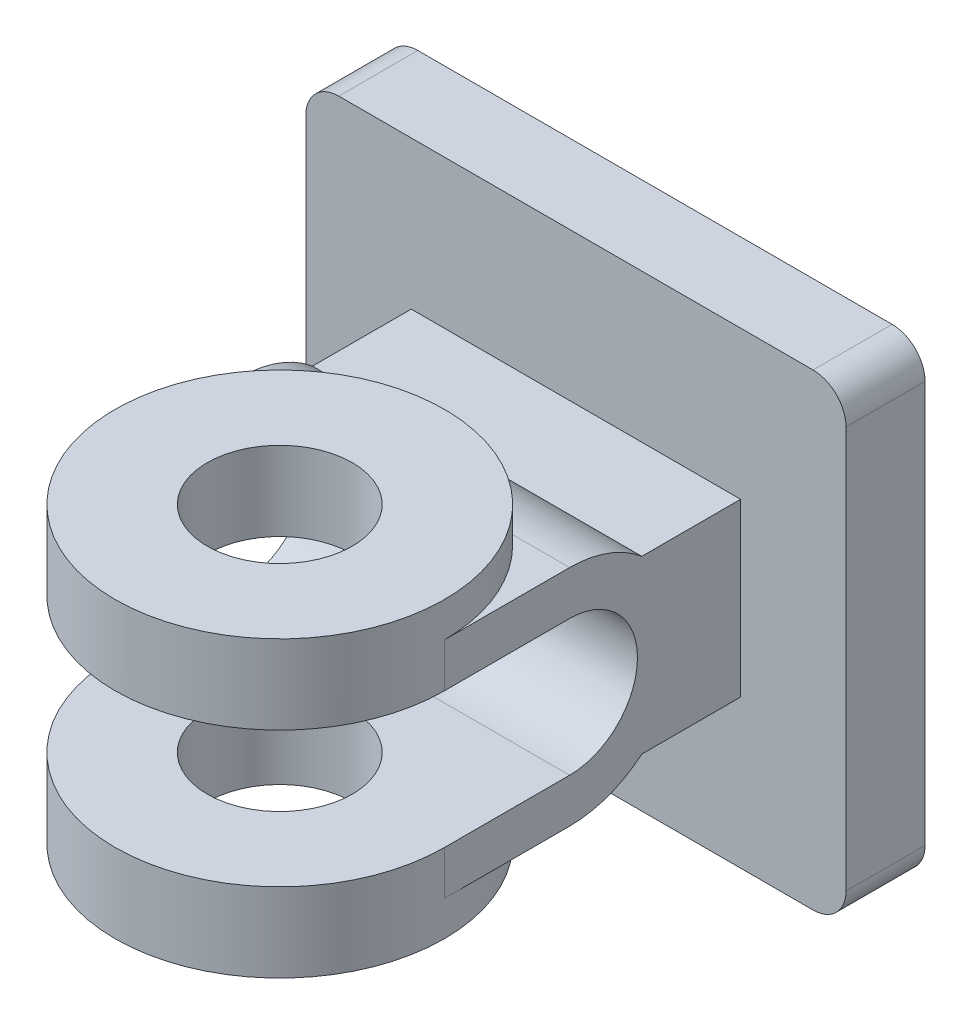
from build123d import *

# Parameters (mm, degrees)
BOSS_EXTRUDE1_DEPTH = 25
SKETCH2_R           = 25
BOSS_EXTRUDE2_DEPTH = 12
SKETCH3_R           = 11
CUT_EXTRUDE1_DEPTH  = 26
SKETCH4_W           = 82
SKETCH4_H           = 71
BOSS_EXTRUDE3_DEPTH = 12
FILLET1_R           = 5
SCALE1_SCALE        = 0.7
SCALE2_SCALE        = 0.5
SCALE3_SCALE        = 1.25


with BuildPart() as part:
    # Sketch1 → Boss-Extrude1 (new, symmetric)
    with BuildSketch(Plane(origin=(0, 0, 0), x_dir=(0, 0, -1), z_dir=(1, 0, 0))):
        with BuildLine():
            Line((10.95445115, 13), (25.95445115, 13))
            Line((25.95445115, 13), (25.95445115, -13))
            Line((25.95445115, -13), (10.95445115, -13))
            ThreePointArc((10.95445115, -13), (5.830951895, -15.968719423), (0, -17))
            Line((0, -17), (-19, -17))
            Line((-19, -17), (-19, -10.3))
            Line((-19, -10.3), (0, -10.3))
            ThreePointArc((0, -10.3), (10.3, 0), (0, 10.3))
            Line((0, 10.3), (-19, 10.3))
            Line((-19, 10.3), (-19, 17))
            Line((-19, 17), (0, 17))
            ThreePointArc((0, 17), (5.830951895, 15.968719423), (10.95445115, 13))
        make_face()
    extrude(amount=BOSS_EXTRUDE1_DEPTH, both=True)

    # Sketch2 → Boss-Extrude2 (add)
    with BuildSketch(Plane(origin=(0, -10.3, 0), x_dir=(1, 0, 0), z_dir=(0, 1, 0))):
        with Locations(Location((0, -19, 0), (0, 0, 270))):
            Circle(SKETCH2_R)
    boss_extrude2 = extrude(amount=-BOSS_EXTRUDE2_DEPTH)

    # Sketch3 → Cut-Extrude1 (cut)
    with BuildSketch(Plane(origin=(0, -10.3, 0), x_dir=(1, 0, 0), z_dir=(0, 1, 0))):
        with Locations(Location((0, -19, 0), (0, 0, 270))):
            Circle(SKETCH3_R)
    cut_extrude1 = extrude(amount=-CUT_EXTRUDE1_DEPTH, mode=Mode.SUBTRACT)

    # Mirror2: Boss-Extrude2, Cut-Extrude1 across plane
    add(boss_extrude2.mirror(Plane.ZX))
    add(cut_extrude1.mirror(Plane.ZX), mode=Mode.SUBTRACT)

    # Sketch4 → Boss-Extrude3 (add)
    with BuildSketch(Plane(origin=(0, 0, -25.95445115), x_dir=(-1, 0, 0), z_dir=(0, 0, -1))):
        Rectangle(SKETCH4_W, SKETCH4_H)
    extrude(amount=BOSS_EXTRUDE3_DEPTH)

    # Fillet1
    fillet1_edges = [part.edges().sort_by_distance(p)[0] for p in [
        (-41, -35.5, -31.95445115),
        (-41, 35.5, -31.95445115),
        (41, 35.5, -31.95445115),
        (41, -35.5, -31.95445115),
    ]]
    fillet(fillet1_edges, radius=FILLET1_R)


with BuildPart() as part_1:
    # Scale1: scaled about (6e-09, -1.74e-07, -14.049627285)
    add(part.part.scale(SCALE1_SCALE).moved(Location((2e-09, -5.2e-08, -4.214888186))))


with BuildPart() as part_2:
    # Scale2: scaled about (6e-09, -1.74e-07, -14.049627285)
    add(part_1.part.scale(SCALE2_SCALE).moved(Location((3e-09, -8.7e-08, -7.024813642))))


with BuildPart() as part_3:
    # Scale3: scaled about (6e-09, -1.74e-07, -14.049627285)
    add(part_2.part.scale(SCALE3_SCALE).moved(Location((-1e-09, 4.3e-08, 3.512406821))))


solid = part_3.part
